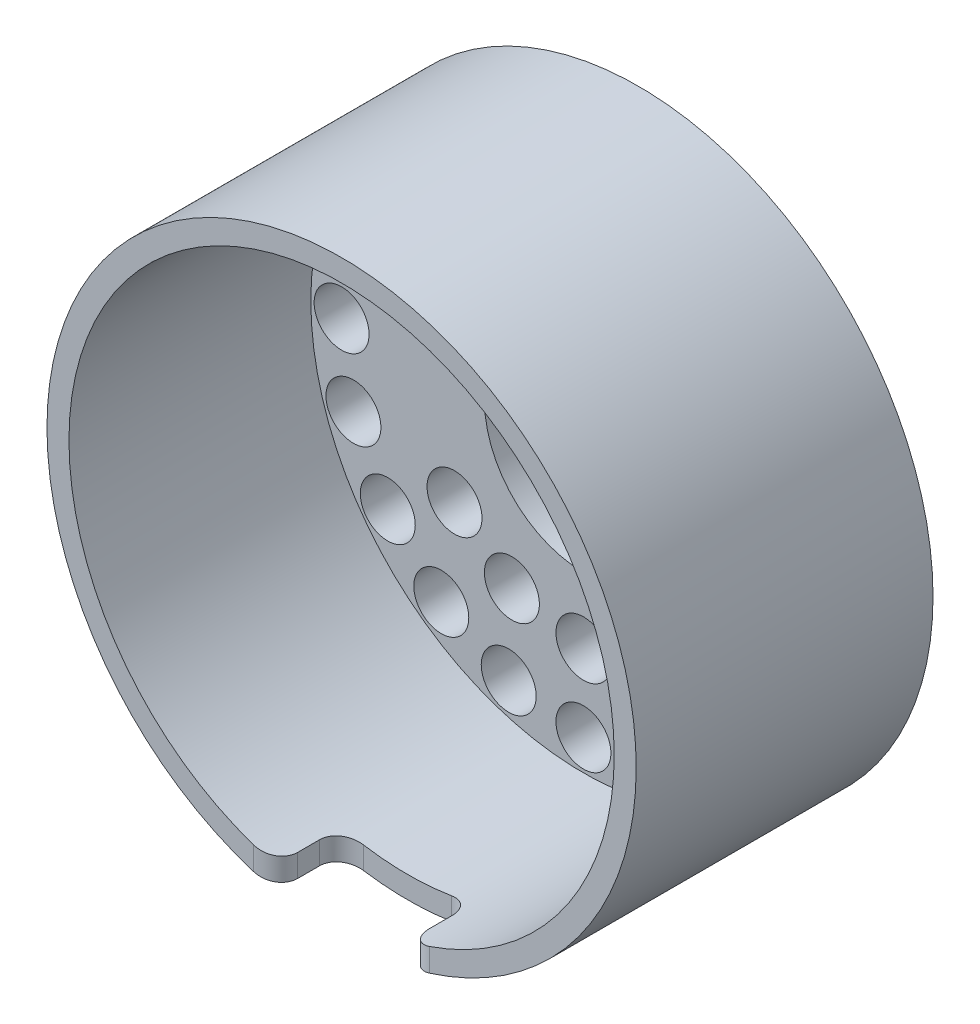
from build123d import *

# Parameters (mm, degrees)
SKETCH1_R               = 34.036
SKETCH1_R_2             = 11.43
BOSS_EXTRUDE1_DEPTH     = 6.35
SKETCH2_W               = 6.731
SKETCH2_H               = 6.731
BOSS_EXTRUDE2_DEPTH     = 10.16
SKETCH3_R               = 34.036
SKETCH3_R_2             = 31.496
BOSS_EXTRUDE3_DEPTH     = 27.94
FILLET1_R               = 1.27
FILLET2_R               = 2.54
CUT_EXTRUDE1_REACH      = 61.099
CUT_EXTRUDE1_END_RADIUS = 34.036
SKETCH4_W               = 15.24
SKETCH4_H               = 7.62
FILLET3_R               = 2.54
SKETCH5_R               = 3.175
CUT_EXTRUDE2_DEPTH      = 6.35
CIRPATTERN1_COUNT       = 14
SKETCH6_R               = 3.175
CUT_EXTRUDE3_DEPTH      = 6.35
CIRPATTERN2_COUNT       = 20


with BuildPart() as part:
    # Sketch1 → Boss-Extrude1 (new body)
    with BuildSketch(Plane.XY):
        Circle(SKETCH1_R)
        Circle(SKETCH1_R_2, mode=Mode.SUBTRACT)
    extrude(amount=BOSS_EXTRUDE1_DEPTH)

    # Sketch2 → Boss-Extrude2 (add)
    with BuildSketch(Plane(origin=(0, 0, 0), x_dir=(-1, 0, 0), z_dir=(0, 0, -1))):
        with Locations((17.4625, 0)):
            Rectangle(SKETCH2_W, SKETCH2_H)
        with Locations((-17.4625, 0)):
            Rectangle(SKETCH2_W, SKETCH2_H)
    extrude(amount=BOSS_EXTRUDE2_DEPTH)

    # Sketch3 → Boss-Extrude3 (add)
    with BuildSketch(Plane.XY.offset(6.35)):
        Circle(SKETCH3_R)
        Circle(SKETCH3_R_2, mode=Mode.SUBTRACT)
    extrude(amount=BOSS_EXTRUDE3_DEPTH)

    # Fillet1
    fillet1_edges = [part.edges().sort_by_distance(p)[0] for p in [
        (-20.828, 0, -10.16),
        (-17.4625, 3.3655, -10.16),
        (-14.097, 0, -10.16),
        (-17.4625, -3.3655, -10.16),
        (14.097, 0, -10.16),
        (17.4625, 3.3655, -10.16),
        (20.828, 0, -10.16),
        (17.4625, -3.3655, -10.16),
    ]]
    fillet(fillet1_edges, radius=FILLET1_R)

    # Fillet2
    fillet2_edges = [part.edges().sort_by_distance(p)[0] for p in [
        (-11.43, 0, 0),
    ]]
    fillet(fillet2_edges, radius=FILLET2_R)

    # Cut-Extrude1: up to this cylinder (the profile starts inside it)
    cut_extrude1_end = Plane(origin=(0, 0, 30.48), z_dir=(0, 0, -1)) * Cylinder(CUT_EXTRUDE1_END_RADIUS, 191.27, mode=Mode.PRIVATE)
    # Sketch4 → Cut-Extrude1 (cut, up to the surface)
    with BuildSketch(Plane(origin=(0, 0, 0), x_dir=(1, 0, 0), z_dir=(0, 1, 0)), mode=Mode.PRIVATE) as cut_extrude1_sk1:
        with Locations((0, -30.48)):
            Rectangle(SKETCH4_W, SKETCH4_H)
    cut_extrude1_tool1 = extrude(cut_extrude1_sk1.sketch, amount=-CUT_EXTRUDE1_REACH, mode=Mode.PRIVATE) & cut_extrude1_end
    add(cut_extrude1_tool1.solids().sort_by_distance((0, 0, 30.48))[0], mode=Mode.SUBTRACT)

    # Fillet3
    fillet3_edges = [part.edges().sort_by_distance(p)[0] for p in [
        (7.62, -31.866188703, 34.29),
        (-7.62, -31.866188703, 34.29),
        (-7.62, -31.866188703, 26.67),
        (7.62, -31.866188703, 26.67),
    ]]
    fillet(fillet3_edges, radius=FILLET3_R)

    # Sketch5 → Cut-Extrude2 (cut)
    with BuildSketch(Plane(origin=(0, 0, 0), x_dir=(-1, 0, 0), z_dir=(0, 0, -1))):
        with Locations((0, 19.05)):
            Circle(SKETCH5_R)
    cut_extrude2 = extrude(amount=-CUT_EXTRUDE2_DEPTH, mode=Mode.SUBTRACT)

    # CirPattern1: Cut-Extrude2 ×14 about axis, 4 skipped
    cirpattern1_axis = Axis((0, 0, 0), (0, 0, -1))
    add([cut_extrude2.rotate(cirpattern1_axis, i * 360 / CIRPATTERN1_COUNT) for i in range(1, CIRPATTERN1_COUNT) if i not in (3, 4, 10, 11)], mode=Mode.SUBTRACT)

    # Sketch6 → Cut-Extrude3 (cut)
    with BuildSketch(Plane(origin=(0, 0, 0), x_dir=(-1, 0, 0), z_dir=(0, 0, -1))):
        with Locations((0, 27.94)):
            Circle(SKETCH6_R)
    cut_extrude3 = extrude(amount=-CUT_EXTRUDE3_DEPTH, mode=Mode.SUBTRACT)

    # CirPattern2: Cut-Extrude3 ×20 about axis
    cirpattern2_axis = Axis((0, 0, 0), (0, 0, 1))
    for i in range(1, CIRPATTERN2_COUNT):
        add(cut_extrude3.rotate(cirpattern2_axis, i * 360 / CIRPATTERN2_COUNT), mode=Mode.SUBTRACT)


solid = part.part
